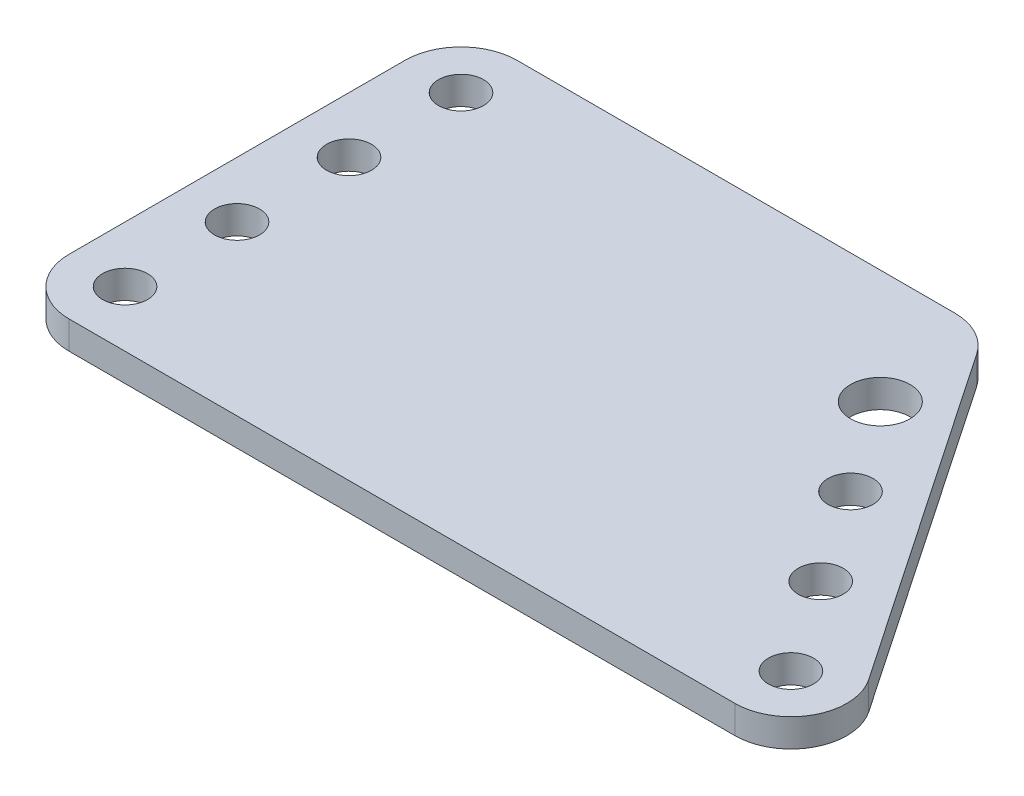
from build123d import *

# Parameters (mm, degrees)
BOSS_EXTRUDE1_DEPTH              = 3.175
F_7_0_201_DIAMETER_HOLE1_D       = 5.1054
F_17_64_0_26563_DIAMETER_HOLE1_D = 6.747002


with BuildPart() as part:
    # Sketch1 → Boss-Extrude1 (new body)
    with BuildSketch(Plane(origin=(0, 0, 0), x_dir=(1, 0, 0), z_dir=(0, 1, 0))):
        with BuildLine():
            Line((6.35, 0), (81.8642, 0))
            ThreePointArc((81.8642, 0), (87.475022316, 3.376589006), (87.118776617, 9.915378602))
            Line((87.118776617, 9.915378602), (61.266850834, 48.015378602))
            ThreePointArc((61.266850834, 48.015378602), (58.985685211, 50.060822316), (56.012274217, 50.8))
            Line((56.012274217, 50.8), (6.35, 50.8))
            ThreePointArc((6.35, 50.8), (1.859871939, 48.940128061), (0, 44.45))
            Line((0, 44.45), (0, 6.35))
            ThreePointArc((0, 6.35), (1.859871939, 1.859871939), (6.35, 0))
        make_face()
    extrude(amount=BOSS_EXTRUDE1_DEPTH)

    # 7 _0.201_ Diameter Hole1 (through all)
    with Locations(Plane(origin=(0, 3.175, 0), x_dir=(1, 0, 0), z_dir=(0, 1, 0))):
        with Locations((6.35, 44.45), (6.35, 6.35), (60.471928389, 37.877459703), (81.8642, 6.35), (6.35, 19.05), (6.35, 31.75), (67.602685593, 27.368306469), (74.733442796, 16.859153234)):
            Hole(F_7_0_201_DIAMETER_HOLE1_D / 2)

    # 17_64 _0.26563_ Diameter Hole1 (through all)
    with Locations(Plane(origin=(0, 3.175, 0), x_dir=(1, 0, 0), z_dir=(0, 1, 0))):
        with Locations((60.471928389, 37.877459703)):
            Hole(F_17_64_0_26563_DIAMETER_HOLE1_D / 2)


solid = part.part
